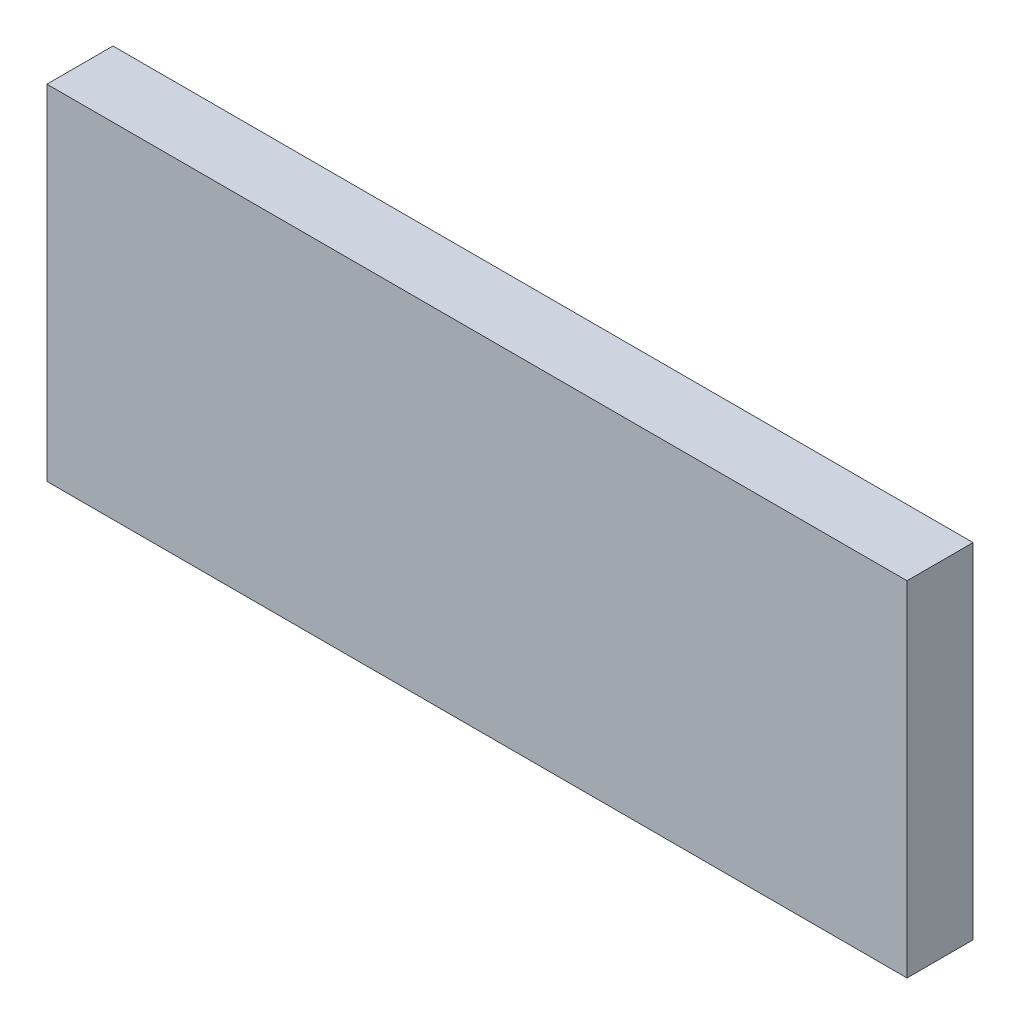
ISO-10303-21;
HEADER;
FILE_DESCRIPTION(('STEP AP214'),'2;1');
FILE_NAME('part.step','',(''),(''),'','','');
FILE_SCHEMA(('AUTOMOTIVE_DESIGN { 1 0 10303 214 1 1 1 1 }'));
ENDSEC;
DATA;
#1=APPLICATION_CONTEXT('core data for automotive mechanical design processes');
#2=APPLICATION_PROTOCOL_DEFINITION('international standard','automotive_design',2000,#1);
#3=PRODUCT_CONTEXT('',#1,'mechanical');
#4=PRODUCT('Part','Part','',(#3));
#5=PRODUCT_RELATED_PRODUCT_CATEGORY('part','',(#4));
#6=PRODUCT_DEFINITION_FORMATION('','',#4);
#7=PRODUCT_DEFINITION_CONTEXT('part definition',#1,'design');
#8=PRODUCT_DEFINITION('design','',#6,#7);
#9=PRODUCT_DEFINITION_SHAPE('','',#8);
#10=(LENGTH_UNIT() NAMED_UNIT(*) SI_UNIT(.MILLI.,.METRE.));
#11=(NAMED_UNIT(*) PLANE_ANGLE_UNIT() SI_UNIT($,.RADIAN.));
#12=(NAMED_UNIT(*) SI_UNIT($,.STERADIAN.) SOLID_ANGLE_UNIT());
#13=UNCERTAINTY_MEASURE_WITH_UNIT(LENGTH_MEASURE(1.E-05),#10,'distance_accuracy_value','');
#14=(GEOMETRIC_REPRESENTATION_CONTEXT(3) GLOBAL_UNCERTAINTY_ASSIGNED_CONTEXT((#13)) GLOBAL_UNIT_ASSIGNED_CONTEXT((#10,
#11,#12)) REPRESENTATION_CONTEXT('',''));
#15=CARTESIAN_POINT('',(0.,0.,0.));
#16=DIRECTION('',(0.,0.,1.));
#17=DIRECTION('',(1.,0.,0.));
#18=AXIS2_PLACEMENT_3D('',#15,#16,#17);
#19=CARTESIAN_POINT('',(7.9375,3.175,-1.2192));
#20=DIRECTION('',(1.,0.,0.));
#21=DIRECTION('',(0.,1.,0.));
#22=AXIS2_PLACEMENT_3D('',#19,#20,#21);
#23=PLANE('',#22);
#24=DIRECTION('',(0.,1.,0.));
#25=VECTOR('',#24,1.);
#26=CARTESIAN_POINT('',(7.9375,3.175,0.));
#27=LINE('',#26,#25);
#28=CARTESIAN_POINT('',(7.9375,-3.175,0.));
#29=VERTEX_POINT('',#28);
#30=CARTESIAN_POINT('',(7.9375,3.175,0.));
#31=VERTEX_POINT('',#30);
#32=EDGE_CURVE('E104',#29,#31,#27,.T.);
#33=ORIENTED_EDGE('',*,*,#32,.F.);
#34=DIRECTION('',(0.,0.,1.));
#35=VECTOR('',#34,1.);
#36=CARTESIAN_POINT('',(7.9375,-3.175,-1.2192));
#37=LINE('',#36,#35);
#38=CARTESIAN_POINT('',(7.9375,-3.175,-1.2192));
#39=VERTEX_POINT('',#38);
#40=EDGE_CURVE('E11',#39,#29,#37,.T.);
#41=ORIENTED_EDGE('',*,*,#40,.F.);
#42=DIRECTION('',(0.,1.,0.));
#43=VECTOR('',#42,1.);
#44=CARTESIAN_POINT('',(7.9375,3.175,-1.2192));
#45=LINE('',#44,#43);
#46=CARTESIAN_POINT('',(7.9375,3.175,-1.2192));
#47=VERTEX_POINT('',#46);
#48=EDGE_CURVE('E98',#39,#47,#45,.T.);
#49=ORIENTED_EDGE('',*,*,#48,.T.);
#50=DIRECTION('',(0.,0.,1.));
#51=VECTOR('',#50,1.);
#52=CARTESIAN_POINT('',(7.9375,3.175,-1.2192));
#53=LINE('',#52,#51);
#54=EDGE_CURVE('E43',#47,#31,#53,.T.);
#55=ORIENTED_EDGE('',*,*,#54,.T.);
#56=EDGE_LOOP('',(#33,#41,#49,#55));
#57=FACE_BOUND('',#56,.T.);
#58=ADVANCED_FACE('F40',(#57),#23,.T.);
#59=CARTESIAN_POINT('',(-7.9375,-3.175,-1.2192));
#60=DIRECTION('',(0.,-1.,0.));
#61=DIRECTION('',(0.,0.,-1.));
#62=AXIS2_PLACEMENT_3D('',#59,#60,#61);
#63=PLANE('',#62);
#64=DIRECTION('',(1.,0.,0.));
#65=VECTOR('',#64,1.);
#66=CARTESIAN_POINT('',(-7.9375,-3.175,0.));
#67=LINE('',#66,#65);
#68=CARTESIAN_POINT('',(-7.9375,-3.175,0.));
#69=VERTEX_POINT('',#68);
#70=EDGE_CURVE('E100',#69,#29,#67,.T.);
#71=ORIENTED_EDGE('',*,*,#70,.F.);
#72=DIRECTION('',(0.,0.,1.));
#73=VECTOR('',#72,1.);
#74=CARTESIAN_POINT('',(-7.9375,-3.175,-1.2192));
#75=LINE('',#74,#73);
#76=CARTESIAN_POINT('',(-7.9375,-3.175,-1.2192));
#77=VERTEX_POINT('',#76);
#78=EDGE_CURVE('E49',#77,#69,#75,.T.);
#79=ORIENTED_EDGE('',*,*,#78,.F.);
#80=DIRECTION('',(1.,0.,0.));
#81=VECTOR('',#80,1.);
#82=CARTESIAN_POINT('',(-7.9375,-3.175,-1.2192));
#83=LINE('',#82,#81);
#84=EDGE_CURVE('E95',#77,#39,#83,.T.);
#85=ORIENTED_EDGE('',*,*,#84,.T.);
#86=ORIENTED_EDGE('',*,*,#40,.T.);
#87=EDGE_LOOP('',(#71,#79,#85,#86));
#88=FACE_BOUND('',#87,.T.);
#89=ADVANCED_FACE('F114',(#88),#63,.T.);
#90=CARTESIAN_POINT('',(-7.9375,3.175,-1.2192));
#91=DIRECTION('',(-1.,0.,0.));
#92=DIRECTION('',(0.,0.,1.));
#93=AXIS2_PLACEMENT_3D('',#90,#91,#92);
#94=PLANE('',#93);
#95=DIRECTION('',(0.,-1.,0.));
#96=VECTOR('',#95,1.);
#97=CARTESIAN_POINT('',(-7.9375,3.175,0.));
#98=LINE('',#97,#96);
#99=CARTESIAN_POINT('',(-7.9375,3.175,0.));
#100=VERTEX_POINT('',#99);
#101=EDGE_CURVE('E90',#100,#69,#98,.T.);
#102=ORIENTED_EDGE('',*,*,#101,.F.);
#103=DIRECTION('',(0.,0.,1.));
#104=VECTOR('',#103,1.);
#105=CARTESIAN_POINT('',(-7.9375,3.175,-1.2192));
#106=LINE('',#105,#104);
#107=CARTESIAN_POINT('',(-7.9375,3.175,-1.2192));
#108=VERTEX_POINT('',#107);
#109=EDGE_CURVE('E85',#108,#100,#106,.T.);
#110=ORIENTED_EDGE('',*,*,#109,.F.);
#111=DIRECTION('',(0.,-1.,0.));
#112=VECTOR('',#111,1.);
#113=CARTESIAN_POINT('',(-7.9375,3.175,-1.2192));
#114=LINE('',#113,#112);
#115=EDGE_CURVE('E88',#108,#77,#114,.T.);
#116=ORIENTED_EDGE('',*,*,#115,.T.);
#117=ORIENTED_EDGE('',*,*,#78,.T.);
#118=EDGE_LOOP('',(#102,#110,#116,#117));
#119=FACE_BOUND('',#118,.T.);
#120=ADVANCED_FACE('F87',(#119),#94,.T.);
#121=CARTESIAN_POINT('',(-7.9375,3.175,-1.2192));
#122=DIRECTION('',(0.,1.,0.));
#123=DIRECTION('',(0.,0.,1.));
#124=AXIS2_PLACEMENT_3D('',#121,#122,#123);
#125=PLANE('',#124);
#126=DIRECTION('',(-1.,0.,0.));
#127=VECTOR('',#126,1.);
#128=CARTESIAN_POINT('',(-7.9375,3.175,0.));
#129=LINE('',#128,#127);
#130=EDGE_CURVE('E107',#31,#100,#129,.T.);
#131=ORIENTED_EDGE('',*,*,#130,.F.);
#132=ORIENTED_EDGE('',*,*,#54,.F.);
#133=DIRECTION('',(-1.,0.,0.));
#134=VECTOR('',#133,1.);
#135=CARTESIAN_POINT('',(-7.9375,3.175,-1.2192));
#136=LINE('',#135,#134);
#137=EDGE_CURVE('E94',#47,#108,#136,.T.);
#138=ORIENTED_EDGE('',*,*,#137,.T.);
#139=ORIENTED_EDGE('',*,*,#109,.T.);
#140=EDGE_LOOP('',(#131,#132,#138,#139));
#141=FACE_BOUND('',#140,.T.);
#142=ADVANCED_FACE('F97',(#141),#125,.T.);
#143=CARTESIAN_POINT('',(0.,0.,-1.2192));
#144=DIRECTION('',(0.,0.,1.));
#145=DIRECTION('',(1.,0.,0.));
#146=AXIS2_PLACEMENT_3D('',#143,#144,#145);
#147=PLANE('',#146);
#148=ORIENTED_EDGE('',*,*,#48,.F.);
#149=ORIENTED_EDGE('',*,*,#84,.F.);
#150=ORIENTED_EDGE('',*,*,#115,.F.);
#151=ORIENTED_EDGE('',*,*,#137,.F.);
#152=EDGE_LOOP('',(#148,#149,#150,#151));
#153=FACE_BOUND('',#152,.T.);
#154=ADVANCED_FACE('F93',(#153),#147,.F.);
#155=CARTESIAN_POINT('',(0.,0.,0.));
#156=DIRECTION('',(0.,0.,1.));
#157=DIRECTION('',(1.,0.,0.));
#158=AXIS2_PLACEMENT_3D('',#155,#156,#157);
#159=PLANE('',#158);
#160=ORIENTED_EDGE('',*,*,#32,.T.);
#161=ORIENTED_EDGE('',*,*,#130,.T.);
#162=ORIENTED_EDGE('',*,*,#101,.T.);
#163=ORIENTED_EDGE('',*,*,#70,.T.);
#164=EDGE_LOOP('',(#160,#161,#162,#163));
#165=FACE_BOUND('',#164,.T.);
#166=ADVANCED_FACE('F113',(#165),#159,.T.);
#167=CLOSED_SHELL('',(#58,#89,#120,#142,#154,#166));
#168=MANIFOLD_SOLID_BREP('B2',#167);
#169=ADVANCED_BREP_SHAPE_REPRESENTATION('',(#18,#168),#14);
#170=SHAPE_DEFINITION_REPRESENTATION(#9,#169);
ENDSEC;
END-ISO-10303-21;
